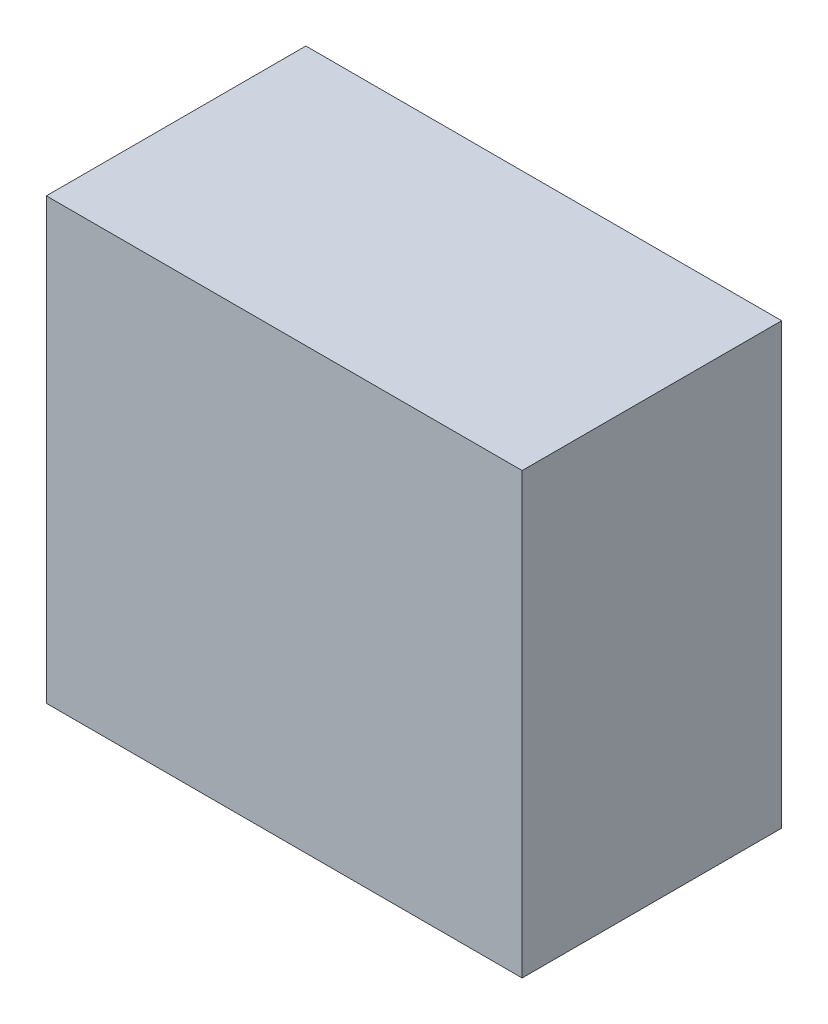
ISO-10303-21;
HEADER;
FILE_DESCRIPTION(('STEP AP214'),'2;1');
FILE_NAME('part.step','',(''),(''),'','','');
FILE_SCHEMA(('AUTOMOTIVE_DESIGN { 1 0 10303 214 1 1 1 1 }'));
ENDSEC;
DATA;
#1=APPLICATION_CONTEXT('core data for automotive mechanical design processes');
#2=APPLICATION_PROTOCOL_DEFINITION('international standard','automotive_design',2000,#1);
#3=PRODUCT_CONTEXT('',#1,'mechanical');
#4=PRODUCT('Part','Part','',(#3));
#5=PRODUCT_RELATED_PRODUCT_CATEGORY('part','',(#4));
#6=PRODUCT_DEFINITION_FORMATION('','',#4);
#7=PRODUCT_DEFINITION_CONTEXT('part definition',#1,'design');
#8=PRODUCT_DEFINITION('design','',#6,#7);
#9=PRODUCT_DEFINITION_SHAPE('','',#8);
#10=(LENGTH_UNIT() NAMED_UNIT(*) SI_UNIT(.MILLI.,.METRE.));
#11=(NAMED_UNIT(*) PLANE_ANGLE_UNIT() SI_UNIT($,.RADIAN.));
#12=(NAMED_UNIT(*) SI_UNIT($,.STERADIAN.) SOLID_ANGLE_UNIT());
#13=UNCERTAINTY_MEASURE_WITH_UNIT(LENGTH_MEASURE(1.E-05),#10,'distance_accuracy_value','');
#14=(GEOMETRIC_REPRESENTATION_CONTEXT(3) GLOBAL_UNCERTAINTY_ASSIGNED_CONTEXT((#13)) GLOBAL_UNIT_ASSIGNED_CONTEXT((#10,
#11,#12)) REPRESENTATION_CONTEXT('',''));
#15=CARTESIAN_POINT('',(0.,0.,0.));
#16=DIRECTION('',(0.,0.,1.));
#17=DIRECTION('',(1.,0.,0.));
#18=AXIS2_PLACEMENT_3D('',#15,#16,#17);
#19=CARTESIAN_POINT('',(0.,0.,1.20000014));
#20=DIRECTION('',(0.,0.,-1.));
#21=DIRECTION('',(0.,-1.,0.));
#22=AXIS2_PLACEMENT_3D('',#19,#20,#21);
#23=PLANE('',#22);
#24=DIRECTION('',(0.,-1.,0.));
#25=VECTOR('',#24,1.);
#26=CARTESIAN_POINT('',(1.10000034,1.016,1.20000014));
#27=LINE('',#26,#25);
#28=CARTESIAN_POINT('',(1.10000034,1.016,1.20000014));
#29=VERTEX_POINT('',#28);
#30=CARTESIAN_POINT('',(1.10000034,-1.016,1.20000014));
#31=VERTEX_POINT('',#30);
#32=EDGE_CURVE('E27',#29,#31,#27,.T.);
#33=ORIENTED_EDGE('',*,*,#32,.F.);
#34=DIRECTION('',(1.,0.,0.));
#35=VECTOR('',#34,1.);
#36=CARTESIAN_POINT('',(-1.10000034,1.016,1.20000014));
#37=LINE('',#36,#35);
#38=CARTESIAN_POINT('',(-1.10000034,1.016,1.20000014));
#39=VERTEX_POINT('',#38);
#40=EDGE_CURVE('E20',#39,#29,#37,.T.);
#41=ORIENTED_EDGE('',*,*,#40,.F.);
#42=DIRECTION('',(0.,1.,0.));
#43=VECTOR('',#42,1.);
#44=CARTESIAN_POINT('',(-1.10000034,-1.016,1.20000014));
#45=LINE('',#44,#43);
#46=CARTESIAN_POINT('',(-1.10000034,-1.016,1.20000014));
#47=VERTEX_POINT('',#46);
#48=EDGE_CURVE('E75',#47,#39,#45,.T.);
#49=ORIENTED_EDGE('',*,*,#48,.F.);
#50=DIRECTION('',(-1.,0.,0.));
#51=VECTOR('',#50,1.);
#52=CARTESIAN_POINT('',(1.10000034,-1.016,1.20000014));
#53=LINE('',#52,#51);
#54=EDGE_CURVE('E115',#31,#47,#53,.T.);
#55=ORIENTED_EDGE('',*,*,#54,.F.);
#56=EDGE_LOOP('',(#33,#41,#49,#55));
#57=FACE_BOUND('',#56,.T.);
#58=ADVANCED_FACE('F17',(#57),#23,.F.);
#59=CARTESIAN_POINT('',(0.,0.,0.));
#60=DIRECTION('',(0.,0.,-1.));
#61=DIRECTION('',(0.,-1.,0.));
#62=AXIS2_PLACEMENT_3D('',#59,#60,#61);
#63=PLANE('',#62);
#64=DIRECTION('',(-1.,0.,0.));
#65=VECTOR('',#64,1.);
#66=CARTESIAN_POINT('',(1.10000034,-1.016,0.));
#67=LINE('',#66,#65);
#68=CARTESIAN_POINT('',(1.10000034,-1.016,0.));
#69=VERTEX_POINT('',#68);
#70=CARTESIAN_POINT('',(-1.10000034,-1.016,0.));
#71=VERTEX_POINT('',#70);
#72=EDGE_CURVE('E91',#69,#71,#67,.T.);
#73=ORIENTED_EDGE('',*,*,#72,.T.);
#74=DIRECTION('',(0.,1.,0.));
#75=VECTOR('',#74,1.);
#76=CARTESIAN_POINT('',(-1.10000034,-1.016,0.));
#77=LINE('',#76,#75);
#78=CARTESIAN_POINT('',(-1.10000034,1.016,0.));
#79=VERTEX_POINT('',#78);
#80=EDGE_CURVE('E79',#71,#79,#77,.T.);
#81=ORIENTED_EDGE('',*,*,#80,.T.);
#82=DIRECTION('',(1.,0.,0.));
#83=VECTOR('',#82,1.);
#84=CARTESIAN_POINT('',(-1.10000034,1.016,0.));
#85=LINE('',#84,#83);
#86=CARTESIAN_POINT('',(1.10000034,1.016,0.));
#87=VERTEX_POINT('',#86);
#88=EDGE_CURVE('E66',#79,#87,#85,.T.);
#89=ORIENTED_EDGE('',*,*,#88,.T.);
#90=DIRECTION('',(0.,-1.,0.));
#91=VECTOR('',#90,1.);
#92=CARTESIAN_POINT('',(1.10000034,1.016,0.));
#93=LINE('',#92,#91);
#94=EDGE_CURVE('E11',#87,#69,#93,.T.);
#95=ORIENTED_EDGE('',*,*,#94,.T.);
#96=EDGE_LOOP('',(#73,#81,#89,#95));
#97=FACE_BOUND('',#96,.T.);
#98=ADVANCED_FACE('F122',(#97),#63,.T.);
#99=CARTESIAN_POINT('',(1.10000034,1.016,0.));
#100=DIRECTION('',(1.,0.,0.));
#101=DIRECTION('',(0.,1.,0.));
#102=AXIS2_PLACEMENT_3D('',#99,#100,#101);
#103=PLANE('',#102);
#104=DIRECTION('',(0.,0.,1.));
#105=VECTOR('',#104,1.);
#106=CARTESIAN_POINT('',(1.10000034,1.016,0.));
#107=LINE('',#106,#105);
#108=EDGE_CURVE('E78',#87,#29,#107,.T.);
#109=ORIENTED_EDGE('',*,*,#108,.T.);
#110=ORIENTED_EDGE('',*,*,#32,.T.);
#111=DIRECTION('',(0.,0.,1.));
#112=VECTOR('',#111,1.);
#113=CARTESIAN_POINT('',(1.10000034,-1.016,0.));
#114=LINE('',#113,#112);
#115=EDGE_CURVE('E111',#69,#31,#114,.T.);
#116=ORIENTED_EDGE('',*,*,#115,.F.);
#117=ORIENTED_EDGE('',*,*,#94,.F.);
#118=EDGE_LOOP('',(#109,#110,#116,#117));
#119=FACE_BOUND('',#118,.T.);
#120=ADVANCED_FACE('F126',(#119),#103,.T.);
#121=CARTESIAN_POINT('',(-1.10000034,1.016,0.));
#122=DIRECTION('',(0.,1.,0.));
#123=DIRECTION('',(1.,0.,0.));
#124=AXIS2_PLACEMENT_3D('',#121,#122,#123);
#125=PLANE('',#124);
#126=DIRECTION('',(0.,0.,1.));
#127=VECTOR('',#126,1.);
#128=CARTESIAN_POINT('',(-1.10000034,1.016,0.));
#129=LINE('',#128,#127);
#130=EDGE_CURVE('E81',#79,#39,#129,.T.);
#131=ORIENTED_EDGE('',*,*,#130,.T.);
#132=ORIENTED_EDGE('',*,*,#40,.T.);
#133=ORIENTED_EDGE('',*,*,#108,.F.);
#134=ORIENTED_EDGE('',*,*,#88,.F.);
#135=EDGE_LOOP('',(#131,#132,#133,#134));
#136=FACE_BOUND('',#135,.T.);
#137=ADVANCED_FACE('F82',(#136),#125,.T.);
#138=CARTESIAN_POINT('',(-1.10000034,-1.016,0.));
#139=DIRECTION('',(-1.,0.,0.));
#140=DIRECTION('',(0.,0.,1.));
#141=AXIS2_PLACEMENT_3D('',#138,#139,#140);
#142=PLANE('',#141);
#143=DIRECTION('',(0.,0.,1.));
#144=VECTOR('',#143,1.);
#145=CARTESIAN_POINT('',(-1.10000034,-1.016,0.));
#146=LINE('',#145,#144);
#147=EDGE_CURVE('E88',#71,#47,#146,.T.);
#148=ORIENTED_EDGE('',*,*,#147,.T.);
#149=ORIENTED_EDGE('',*,*,#48,.T.);
#150=ORIENTED_EDGE('',*,*,#130,.F.);
#151=ORIENTED_EDGE('',*,*,#80,.F.);
#152=EDGE_LOOP('',(#148,#149,#150,#151));
#153=FACE_BOUND('',#152,.T.);
#154=ADVANCED_FACE('F86',(#153),#142,.T.);
#155=CARTESIAN_POINT('',(1.10000034,-1.016,0.));
#156=DIRECTION('',(0.,-1.,0.));
#157=DIRECTION('',(0.,0.,-1.));
#158=AXIS2_PLACEMENT_3D('',#155,#156,#157);
#159=PLANE('',#158);
#160=ORIENTED_EDGE('',*,*,#115,.T.);
#161=ORIENTED_EDGE('',*,*,#54,.T.);
#162=ORIENTED_EDGE('',*,*,#147,.F.);
#163=ORIENTED_EDGE('',*,*,#72,.F.);
#164=EDGE_LOOP('',(#160,#161,#162,#163));
#165=FACE_BOUND('',#164,.T.);
#166=ADVANCED_FACE('F125',(#165),#159,.T.);
#167=CLOSED_SHELL('',(#58,#98,#120,#137,#154,#166));
#168=MANIFOLD_SOLID_BREP('B1',#167);
#169=ADVANCED_BREP_SHAPE_REPRESENTATION('',(#18,#168),#14);
#170=SHAPE_DEFINITION_REPRESENTATION(#9,#169);
ENDSEC;
END-ISO-10303-21;
